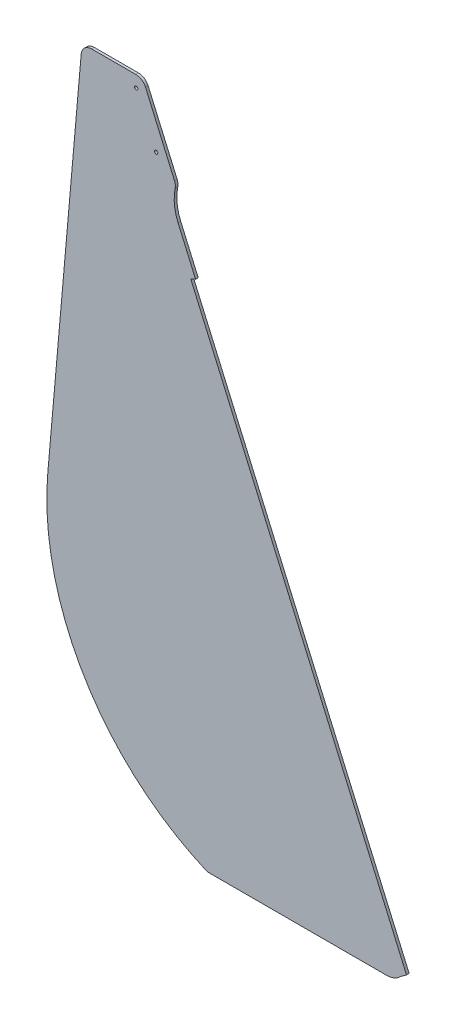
from build123d import *

# Parameters (mm, degrees)
BOSS_EXTRUDE2_DEPTH = 3.175
SKETCH4_R           = 2
CUT_EXTRUDE1_DEPTH  = 589.33529609
SKETCH7_W           = 3.175
SKETCH7_H           = 647.7
CUT_EXTRUDE2_DEPTH  = 6.35
SKETCH10_W          = 6.35
SKETCH10_H          = 3.175
CUT_EXTRUDE5_DEPTH  = 635


with BuildPart() as part:
    # Sketch1 → Boss-Extrude2 (new body)
    with BuildSketch(Plane.XY):
        with BuildLine():
            Line((-126.889709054, 291.041666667), (-159.613848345, 366.099668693))
            ThreePointArc((-159.613848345, 366.099668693), (-164.035960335, 382.889500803), (-163.173742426, 400.230496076))
            ThreePointArc((-163.173742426, 400.230496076), (-162.980750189, 404.111971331), (-163.970561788, 407.870078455))
            Line((-163.970561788, 407.870078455), (-198.764541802, 487.675588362))
            ThreePointArc((-198.764541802, 487.675588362), (-203.448118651, 493.224264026), (-210.406208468, 495.3))
            Line((-210.406208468, 495.3), (-263.487147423, 495.3))
            ThreePointArc((-263.487147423, 495.3), (-272.064543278, 491.965803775), (-276.138203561, 483.713902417))
            Line((-276.138203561, 483.713902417), (-316.276403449, 27.847560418))
            ThreePointArc((-316.276403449, 27.847560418), (-272.301382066, -163.273412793), (-124.434078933, -292.1))
            Line((-124.434078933, -292.1), (91.44, -292.1))
            ThreePointArc((91.44, -292.1), (100.046052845, -290.366131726), (107.30931496, -285.435060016))
            Line((107.30931496, -285.435060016), (120.261045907, -275.837776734))
            Line((120.261045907, -275.837776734), (117.4706968, -269.437668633))
            Line((117.4706968, -269.437668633), (116.277115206, -266.7))
            Line((116.277115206, -266.7), (0, 0))
            Line((0, 0), (-126.889709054, 291.041666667))
        make_face()
    extrude(amount=BOSS_EXTRUDE2_DEPTH)

    # Sketch4 → Cut-Extrude1 (cut, through all)
    with BuildSketch(Plane.XY.offset(3.175)):
        with Locations((-185.969266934, 426.55)):
            Circle(SKETCH4_R)
        with Locations((-209.94842455, 481.55)):
            Circle(SKETCH4_R)
    extrude(amount=-CUT_EXTRUDE1_DEPTH, mode=Mode.SUBTRACT)

    # Sketch7 → Cut-Extrude2 (cut)
    with BuildSketch(Plane(origin=(0, 0, 0), x_dir=(0, 0, -1), z_dir=(0.9166666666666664, 0.39965262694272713, 0))):
        with Locations((-1.5875, 22.936061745)):
            Rectangle(SKETCH7_W, SKETCH7_H)
    extrude(amount=-CUT_EXTRUDE2_DEPTH, mode=Mode.SUBTRACT)

    # Sketch10 → Cut-Extrude5 (cut)
    with BuildSketch(Plane(origin=(120.261045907, -275.837776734, 0), x_dir=(0.9166666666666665, 0.39965262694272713, 0), z_dir=(-0.39965262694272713, 0.9166666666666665, 0))):
        with Locations((-3.175, -1.5875)):
            Rectangle(SKETCH10_W, SKETCH10_H)
    extrude(amount=-CUT_EXTRUDE5_DEPTH, mode=Mode.SUBTRACT)


solid = part.part
